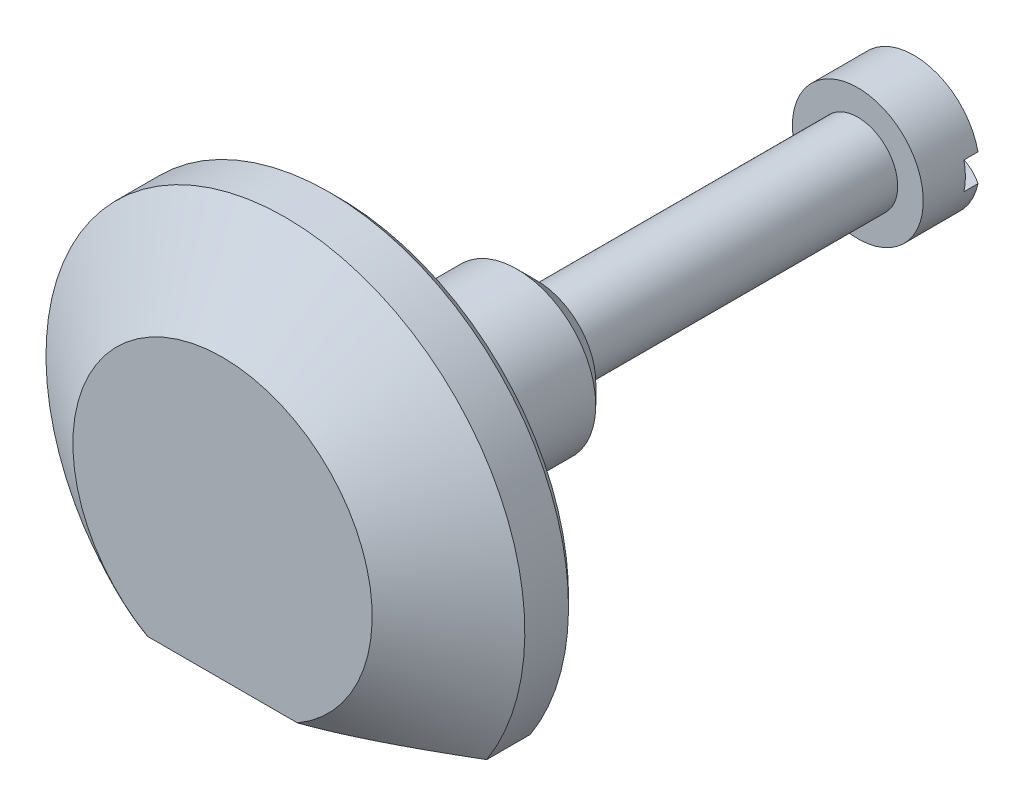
ISO-10303-21;
HEADER;
FILE_DESCRIPTION(('STEP AP214'),'2;1');
FILE_NAME('part.step','',(''),(''),'','','');
FILE_SCHEMA(('AUTOMOTIVE_DESIGN { 1 0 10303 214 1 1 1 1 }'));
ENDSEC;
DATA;
#1=APPLICATION_CONTEXT('core data for automotive mechanical design processes');
#2=APPLICATION_PROTOCOL_DEFINITION('international standard','automotive_design',2000,#1);
#3=PRODUCT_CONTEXT('',#1,'mechanical');
#4=PRODUCT('Part','Part','',(#3));
#5=PRODUCT_RELATED_PRODUCT_CATEGORY('part','',(#4));
#6=PRODUCT_DEFINITION_FORMATION('','',#4);
#7=PRODUCT_DEFINITION_CONTEXT('part definition',#1,'design');
#8=PRODUCT_DEFINITION('design','',#6,#7);
#9=PRODUCT_DEFINITION_SHAPE('','',#8);
#10=(LENGTH_UNIT() NAMED_UNIT(*) SI_UNIT(.MILLI.,.METRE.));
#11=(NAMED_UNIT(*) PLANE_ANGLE_UNIT() SI_UNIT($,.RADIAN.));
#12=(NAMED_UNIT(*) SI_UNIT($,.STERADIAN.) SOLID_ANGLE_UNIT());
#13=UNCERTAINTY_MEASURE_WITH_UNIT(LENGTH_MEASURE(1.E-05),#10,'distance_accuracy_value','');
#14=(GEOMETRIC_REPRESENTATION_CONTEXT(3) GLOBAL_UNCERTAINTY_ASSIGNED_CONTEXT((#13)) GLOBAL_UNIT_ASSIGNED_CONTEXT((#10,
#11,#12)) REPRESENTATION_CONTEXT('',''));
#15=CARTESIAN_POINT('',(0.,0.,0.));
#16=DIRECTION('',(0.,0.,1.));
#17=DIRECTION('',(1.,0.,0.));
#18=AXIS2_PLACEMENT_3D('',#15,#16,#17);
#19=CARTESIAN_POINT('',(0.,3.13055,0.));
#20=DIRECTION('',(0.,0.,1.));
#21=DIRECTION('',(1.,0.,0.));
#22=AXIS2_PLACEMENT_3D('',#19,#20,#21);
#23=PLANE('',#22);
#24=CARTESIAN_POINT('',(0.,0.,0.));
#25=DIRECTION('',(0.,0.,1.));
#26=DIRECTION('',(1.,0.,0.));
#27=AXIS2_PLACEMENT_3D('',#24,#25,#26);
#28=CIRCLE('',#27,3.13055);
#29=CARTESIAN_POINT('',(3.13055,0.,0.));
#30=VERTEX_POINT('',#29);
#31=EDGE_CURVE('E176',#30,#30,#28,.T.);
#32=ORIENTED_EDGE('',*,*,#31,.T.);
#33=EDGE_LOOP('',(#32));
#34=FACE_BOUND('',#33,.T.);
#35=DIRECTION('',(1.,0.,0.));
#36=VECTOR('',#35,1.);
#37=CARTESIAN_POINT('',(0.,-5.1562,0.));
#38=LINE('',#37,#36);
#39=CARTESIAN_POINT('',(-7.53311759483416,-5.1562,0.));
#40=VERTEX_POINT('',#39);
#41=CARTESIAN_POINT('',(7.53311759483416,-5.1562,0.));
#42=VERTEX_POINT('',#41);
#43=EDGE_CURVE('E60',#40,#42,#38,.T.);
#44=ORIENTED_EDGE('',*,*,#43,.F.);
#45=CARTESIAN_POINT('',(0.,0.,0.));
#46=DIRECTION('',(0.,0.,1.));
#47=DIRECTION('',(1.,0.,0.));
#48=AXIS2_PLACEMENT_3D('',#45,#46,#47);
#49=CIRCLE('',#48,9.12876);
#50=EDGE_CURVE('E174',#42,#40,#49,.T.);
#51=ORIENTED_EDGE('',*,*,#50,.F.);
#52=EDGE_LOOP('',(#44,#51));
#53=FACE_BOUND('',#52,.T.);
#54=ADVANCED_FACE('F14',(#34,#53),#23,.F.);
#55=CARTESIAN_POINT('',(0.,0.,0.));
#56=DIRECTION('',(0.,0.,1.));
#57=DIRECTION('',(1.,0.,0.));
#58=AXIS2_PLACEMENT_3D('',#55,#56,#57);
#59=CONICAL_SURFACE('',#58,9.12876,0.785398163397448);
#60=CARTESIAN_POINT('',(-15.2490444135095,-5.1562,6.9684370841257));
#61=CARTESIAN_POINT('',(-14.9291086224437,-5.1562,6.66537868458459));
#62=CARTESIAN_POINT('',(-14.6087024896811,-5.1562,6.36281474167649));
#63=CARTESIAN_POINT('',(-13.9667153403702,-5.1562,5.75893611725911));
#64=CARTESIAN_POINT('',(-13.6451343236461,-5.1562,5.45762143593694));
#65=CARTESIAN_POINT('',(-13.0006472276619,-5.1562,4.85658004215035));
#66=CARTESIAN_POINT('',(-12.677741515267,-5.1562,4.55685293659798));
#67=CARTESIAN_POINT('',(-12.0302017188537,-5.1562,3.95927180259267));
#68=CARTESIAN_POINT('',(-11.7055676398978,-5.1562,3.66141776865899));
#69=CARTESIAN_POINT('',(-11.054076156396,-5.1562,3.06799840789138));
#70=CARTESIAN_POINT('',(-10.7272182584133,-5.1562,2.77243362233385));
#71=CARTESIAN_POINT('',(-10.0707990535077,-5.1562,2.18433331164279));
#72=CARTESIAN_POINT('',(-9.74123782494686,-5.1562,1.89179769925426));
#73=CARTESIAN_POINT('',(-9.24423119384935,-5.1562,1.45594142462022));
#74=CARTESIAN_POINT('',(-9.07809509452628,-5.1562,1.31112742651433));
#75=CARTESIAN_POINT('',(-8.74482041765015,-5.1562,1.02265926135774));
#76=CARTESIAN_POINT('',(-8.577681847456,-5.1562,0.879005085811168));
#77=CARTESIAN_POINT('',(-8.24223899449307,-5.1562,0.593029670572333));
#78=CARTESIAN_POINT('',(-8.07393460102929,-5.1562,0.450708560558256));
#79=CARTESIAN_POINT('',(-7.73598488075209,-5.1562,0.167659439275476));
#80=CARTESIAN_POINT('',(-7.56633952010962,-5.1562,0.0269314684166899));
#81=CARTESIAN_POINT('',(-7.39593235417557,-5.1562,-0.1128732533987));
#82=B_SPLINE_CURVE_WITH_KNOTS('',3,(#60,#61,#62,#63,#64,#65,#66,#67,#68,#69,#70,#71,#72,#73,#74,
#75,#76,#77,#78,#79,#80,#81),.UNSPECIFIED.,.F.,.F.,(4,2,2,2,2,2,2,2,2,2,4),(0.,1.32205673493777,
2.64411366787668,3.96582632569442,5.28753511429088,6.60954741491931,7.9315215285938,
8.59269093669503,9.25385549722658,9.91508372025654,10.5763286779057),.UNSPECIFIED.);
#83=CARTESIAN_POINT('',(-8.00869693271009,-5.1562,0.39624));
#84=VERTEX_POINT('',#83);
#85=EDGE_CURVE('E151',#84,#40,#82,.T.);
#86=ORIENTED_EDGE('',*,*,#85,.F.);
#87=CARTESIAN_POINT('',(0.,0.,0.39624));
#88=DIRECTION('',(0.,0.,1.));
#89=DIRECTION('',(1.,0.,0.));
#90=AXIS2_PLACEMENT_3D('',#87,#88,#89);
#91=CIRCLE('',#90,9.525);
#92=CARTESIAN_POINT('',(8.00869693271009,-5.1562,0.39624));
#93=VERTEX_POINT('',#92);
#94=EDGE_CURVE('E171',#93,#84,#91,.T.);
#95=ORIENTED_EDGE('',*,*,#94,.F.);
#96=CARTESIAN_POINT('',(7.39593235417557,-5.1562,-0.1128732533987));
#97=CARTESIAN_POINT('',(7.56633952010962,-5.1562,0.0269314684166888));
#98=CARTESIAN_POINT('',(7.73598488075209,-5.1562,0.167659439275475));
#99=CARTESIAN_POINT('',(8.07393460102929,-5.1562,0.450708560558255));
#100=CARTESIAN_POINT('',(8.24223899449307,-5.1562,0.593029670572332));
#101=CARTESIAN_POINT('',(8.577681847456,-5.1562,0.879005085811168));
#102=CARTESIAN_POINT('',(8.74482041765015,-5.1562,1.02265926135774));
#103=CARTESIAN_POINT('',(9.07809509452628,-5.1562,1.31112742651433));
#104=CARTESIAN_POINT('',(9.24423119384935,-5.1562,1.45594142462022));
#105=CARTESIAN_POINT('',(9.74123782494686,-5.1562,1.89179769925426));
#106=CARTESIAN_POINT('',(10.0707990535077,-5.1562,2.1843333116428));
#107=CARTESIAN_POINT('',(10.7272182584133,-5.1562,2.77243362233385));
#108=CARTESIAN_POINT('',(11.054076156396,-5.1562,3.06799840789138));
#109=CARTESIAN_POINT('',(11.7055676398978,-5.1562,3.66141776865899));
#110=CARTESIAN_POINT('',(12.0302017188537,-5.1562,3.95927180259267));
#111=CARTESIAN_POINT('',(12.677741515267,-5.1562,4.55685293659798));
#112=CARTESIAN_POINT('',(13.0006472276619,-5.1562,4.85658004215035));
#113=CARTESIAN_POINT('',(13.6451343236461,-5.1562,5.45762143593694));
#114=CARTESIAN_POINT('',(13.9667153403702,-5.1562,5.75893611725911));
#115=CARTESIAN_POINT('',(14.6087024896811,-5.1562,6.36281474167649));
#116=CARTESIAN_POINT('',(14.9291086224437,-5.1562,6.66537868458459));
#117=CARTESIAN_POINT('',(15.2490444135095,-5.1562,6.9684370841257));
#118=B_SPLINE_CURVE_WITH_KNOTS('',3,(#96,#97,#98,#99,#100,#101,#102,#103,#104,#105,#106,#107,
#108,#109,#110,#111,#112,#113,#114,#115,#116,#117),.UNSPECIFIED.,.F.,.F.,(4,2,2,2,2,2,2,2,2,2,
4),(0.,0.661244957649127,1.32247318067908,1.98363774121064,2.64480714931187,3.96678126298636,
5.28879356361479,6.61050235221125,7.93221501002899,9.2542719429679,10.5763286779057),.UNSPECIFIED.);
#119=EDGE_CURVE('E67',#42,#93,#118,.T.);
#120=ORIENTED_EDGE('',*,*,#119,.F.);
#121=ORIENTED_EDGE('',*,*,#50,.T.);
#122=EDGE_LOOP('',(#86,#95,#120,#121));
#123=FACE_BOUND('',#122,.T.);
#124=ADVANCED_FACE('F144',(#123),#59,.T.);
#125=CARTESIAN_POINT('',(0.,0.,4.6355));
#126=DIRECTION('',(0.,0.,1.));
#127=DIRECTION('',(1.,0.,0.));
#128=AXIS2_PLACEMENT_3D('',#125,#126,#127);
#129=CYLINDRICAL_SURFACE('',#128,9.525);
#130=DIRECTION('',(0.,0.,1.));
#131=VECTOR('',#130,1.);
#132=CARTESIAN_POINT('',(8.00869693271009,-5.1562,4.6355));
#133=LINE('',#132,#131);
#134=CARTESIAN_POINT('',(8.00869693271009,-5.1562,2.13444619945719));
#135=VERTEX_POINT('',#134);
#136=EDGE_CURVE('E163',#93,#135,#133,.T.);
#137=ORIENTED_EDGE('',*,*,#136,.F.);
#138=ORIENTED_EDGE('',*,*,#94,.T.);
#139=DIRECTION('',(0.,0.,1.));
#140=VECTOR('',#139,1.);
#141=CARTESIAN_POINT('',(-8.00869693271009,-5.1562,4.6355));
#142=LINE('',#141,#140);
#143=CARTESIAN_POINT('',(-8.00869693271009,-5.1562,2.13444619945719));
#144=VERTEX_POINT('',#143);
#145=EDGE_CURVE('E128',#144,#84,#142,.F.);
#146=ORIENTED_EDGE('',*,*,#145,.F.);
#147=CARTESIAN_POINT('',(0.,0.,2.13444619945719));
#148=DIRECTION('',(0.,0.,1.));
#149=DIRECTION('',(1.,0.,0.));
#150=AXIS2_PLACEMENT_3D('',#147,#148,#149);
#151=CIRCLE('',#150,9.525);
#152=EDGE_CURVE('E168',#135,#144,#151,.T.);
#153=ORIENTED_EDGE('',*,*,#152,.F.);
#154=EDGE_LOOP('',(#137,#138,#146,#153));
#155=FACE_BOUND('',#154,.T.);
#156=ADVANCED_FACE('F140',(#155),#129,.T.);
#157=CARTESIAN_POINT('',(0.,0.,2.13444619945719));
#158=DIRECTION('',(0.,0.,-1.));
#159=DIRECTION('',(-1.,0.,0.));
#160=AXIS2_PLACEMENT_3D('',#157,#158,#159);
#161=CONICAL_SURFACE('',#160,9.525,0.959931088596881);
#162=CARTESIAN_POINT('',(-16.2946755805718,-5.1562,-3.16333570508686));
#163=CARTESIAN_POINT('',(-15.9418236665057,-5.1562,-2.92779299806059));
#164=CARTESIAN_POINT('',(-15.5886625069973,-5.1562,-2.69271174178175));
#165=CARTESIAN_POINT('',(-14.8815593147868,-5.1562,-2.22371603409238));
#166=CARTESIAN_POINT('',(-14.5276172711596,-5.1562,-1.98980159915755));
#167=CARTESIAN_POINT('',(-13.8186083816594,-5.1562,-1.5232640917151));
#168=CARTESIAN_POINT('',(-13.4635410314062,-5.1562,-1.29064178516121));
#169=CARTESIAN_POINT('',(-12.7522573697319,-5.1562,-0.827163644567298));
#170=CARTESIAN_POINT('',(-12.3960410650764,-5.1562,-0.59630780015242));
#171=CARTESIAN_POINT('',(-11.6814300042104,-5.1562,-0.136341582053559));
#172=CARTESIAN_POINT('',(-11.3230322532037,-5.1562,0.0927641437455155));
#173=CARTESIAN_POINT('',(-10.6044173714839,-5.1562,0.548103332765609));
#174=CARTESIAN_POINT('',(-10.2442002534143,-5.1562,0.774336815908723));
#175=CARTESIAN_POINT('',(-9.52150395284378,-5.1562,1.22298464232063));
#176=CARTESIAN_POINT('',(-9.15902529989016,-5.1562,1.44539983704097));
#177=CARTESIAN_POINT('',(-8.43101285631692,-5.1562,1.88516404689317));
#178=CARTESIAN_POINT('',(-8.06547917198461,-5.1562,2.10251323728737));
#179=CARTESIAN_POINT('',(-7.36381887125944,-5.1562,2.51070930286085));
#180=CARTESIAN_POINT('',(-7.02804809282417,-5.1562,2.70216629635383));
#181=CARTESIAN_POINT('',(-6.35198035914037,-5.1562,3.07712959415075));
#182=CARTESIAN_POINT('',(-6.01168264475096,-5.1562,3.2606345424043));
#183=CARTESIAN_POINT('',(-5.49609912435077,-5.1562,3.52767565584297));
#184=CARTESIAN_POINT('',(-5.32302901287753,-5.1562,3.61548801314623));
#185=CARTESIAN_POINT('',(-4.97515941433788,-5.1562,3.78761013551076));
#186=CARTESIAN_POINT('',(-4.80036000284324,-5.1562,3.87192005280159));
#187=CARTESIAN_POINT('',(-4.44879863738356,-5.1562,4.03628148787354));
#188=CARTESIAN_POINT('',(-4.27203703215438,-5.1562,4.11633374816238));
#189=CARTESIAN_POINT('',(-3.91626142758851,-5.1562,4.27124316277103));
#190=CARTESIAN_POINT('',(-3.73724758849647,-5.1562,4.34610068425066));
#191=CARTESIAN_POINT('',(-3.31813942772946,-5.1562,4.51274431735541));
#192=CARTESIAN_POINT('',(-3.07707950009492,-5.1562,4.60213847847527));
#193=CARTESIAN_POINT('',(-2.58999906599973,-5.1562,4.76639266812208));
#194=CARTESIAN_POINT('',(-2.34397861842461,-5.1562,4.84125286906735));
#195=CARTESIAN_POINT('',(-1.849428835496,-5.1562,4.9716052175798));
#196=CARTESIAN_POINT('',(-1.60095176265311,-5.1562,5.02728966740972));
#197=CARTESIAN_POINT('',(-1.22528151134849,-5.1562,5.09394620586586));
#198=CARTESIAN_POINT('',(-1.09956065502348,-5.1562,5.11335379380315));
#199=CARTESIAN_POINT('',(-0.847339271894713,-5.1562,5.14611473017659));
#200=CARTESIAN_POINT('',(-0.720838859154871,-5.1562,5.15946894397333));
#201=CARTESIAN_POINT('',(-0.465478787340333,-5.1562,5.17993477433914));
#202=CARTESIAN_POINT('',(-0.336611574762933,-5.1562,5.18695276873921));
#203=CARTESIAN_POINT('',(-0.0786856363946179,-5.1562,5.19422000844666));
#204=CARTESIAN_POINT('',(0.0503730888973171,-5.1562,5.19446927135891));
#205=CARTESIAN_POINT('',(0.308325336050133,-5.1562,5.18818969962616));
#206=CARTESIAN_POINT('',(0.437218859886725,-5.1562,5.18166094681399));
#207=CARTESIAN_POINT('',(0.694489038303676,-5.1562,5.16201335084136));
#208=CARTESIAN_POINT('',(0.822865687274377,-5.1562,5.148894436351));
#209=CARTESIAN_POINT('',(1.20931527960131,-5.1562,5.09980511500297));
#210=CARTESIAN_POINT('',(1.46621564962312,-5.1562,5.05417214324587));
#211=CARTESIAN_POINT('',(1.84781769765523,-5.1562,4.96961286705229));
#212=CARTESIAN_POINT('',(1.97441693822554,-5.1562,4.93873419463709));
#213=CARTESIAN_POINT('',(2.22635087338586,-5.1562,4.87218079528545));
#214=CARTESIAN_POINT('',(2.35168562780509,-5.1562,4.83650629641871));
#215=CARTESIAN_POINT('',(2.68420811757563,-5.1562,4.73570944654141));
#216=CARTESIAN_POINT('',(2.89025078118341,-5.1562,4.66681252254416));
#217=CARTESIAN_POINT('',(3.29894868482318,-5.1562,4.51954849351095));
#218=CARTESIAN_POINT('',(3.50160285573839,-5.1562,4.44117846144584));
#219=CARTESIAN_POINT('',(3.90405989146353,-5.1562,4.27680455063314));
#220=CARTESIAN_POINT('',(4.10385897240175,-5.1562,4.19079146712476));
#221=CARTESIAN_POINT('',(4.50072282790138,-5.1562,4.01275840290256));
#222=CARTESIAN_POINT('',(4.69778786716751,-5.1562,3.92073900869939));
#223=CARTESIAN_POINT('',(5.09042450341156,-5.1562,3.73147813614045));
#224=CARTESIAN_POINT('',(5.2859860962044,-5.1562,3.63421598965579));
#225=CARTESIAN_POINT('',(5.67510716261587,-5.1562,3.43577038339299));
#226=CARTESIAN_POINT('',(5.86866659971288,-5.1562,3.33458685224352));
#227=CARTESIAN_POINT('',(6.25395450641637,-5.1562,3.12909736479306));
#228=CARTESIAN_POINT('',(6.44568408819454,-5.1562,3.02479348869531));
#229=CARTESIAN_POINT('',(6.82769447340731,-5.1562,2.81356203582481));
#230=CARTESIAN_POINT('',(7.01797524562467,-5.1562,2.7066344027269));
#231=CARTESIAN_POINT('',(7.59406162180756,-5.1562,2.37857455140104));
#232=CARTESIAN_POINT('',(7.97792906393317,-5.1562,2.15403955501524));
#233=CARTESIAN_POINT('',(8.74196372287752,-5.1562,1.69868588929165));
#234=CARTESIAN_POINT('',(9.12213044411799,-5.1562,1.46786639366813));
#235=CARTESIAN_POINT('',(9.8785742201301,-5.1562,1.00233518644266));
#236=CARTESIAN_POINT('',(10.2548592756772,-5.1562,0.767636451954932));
#237=CARTESIAN_POINT('',(11.0052756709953,-5.1562,0.294867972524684));
#238=CARTESIAN_POINT('',(11.3794071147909,-5.1562,0.0567983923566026));
#239=CARTESIAN_POINT('',(12.0740348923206,-5.1562,-0.388606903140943));
#240=CARTESIAN_POINT('',(12.3947467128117,-5.1562,-0.595607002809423));
#241=CARTESIAN_POINT('',(13.0351611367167,-5.1562,-1.01116310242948));
#242=CARTESIAN_POINT('',(13.3548637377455,-5.1562,-1.21971910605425));
#243=CARTESIAN_POINT('',(14.3127378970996,-5.1562,-1.84728598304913));
#244=CARTESIAN_POINT('',(14.9496683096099,-5.1562,-2.26819089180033));
#245=CARTESIAN_POINT('',(16.2212449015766,-5.1562,-3.11350970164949));
#246=CARTESIAN_POINT('',(16.8558909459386,-5.1562,-3.53792380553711));
#247=CARTESIAN_POINT('',(18.123487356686,-5.1562,-4.38927846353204));
#248=CARTESIAN_POINT('',(18.756437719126,-5.1562,-4.81621902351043));
#249=CARTESIAN_POINT('',(20.0219217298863,-5.1562,-5.67255757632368));
#250=CARTESIAN_POINT('',(20.6544536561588,-5.1562,-6.10195811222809));
#251=CARTESIAN_POINT('',(21.9185355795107,-5.1562,-6.96220350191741));
#252=CARTESIAN_POINT('',(22.5500855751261,-5.1562,-7.39304835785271));
#253=CARTESIAN_POINT('',(24.4435518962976,-5.1562,-8.68722608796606));
#254=CARTESIAN_POINT('',(25.7043257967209,-5.1562,-9.55223009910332));
#255=CARTESIAN_POINT('',(28.117202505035,-5.1562,-11.2116930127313));
#256=CARTESIAN_POINT('',(29.2694642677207,-5.1562,-12.0059210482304));
#257=CARTESIAN_POINT('',(31.5728313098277,-5.1562,-13.5960765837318));
#258=CARTESIAN_POINT('',(32.723936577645,-5.1562,-14.3920041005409));
#259=CARTESIAN_POINT('',(35.0236143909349,-5.1562,-15.983918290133));
#260=CARTESIAN_POINT('',(36.172188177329,-5.1562,-16.7799031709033));
#261=CARTESIAN_POINT('',(38.4686728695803,-5.1562,-18.3728016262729));
#262=CARTESIAN_POINT('',(39.6165837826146,-5.1562,-19.1697151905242));
#263=CARTESIAN_POINT('',(40.7642674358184,-5.1562,-19.966955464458));
#264=B_SPLINE_CURVE_WITH_KNOTS('',3,(#162,#163,#164,#165,#166,#167,#168,#169,#170,#171,#172,
#173,#174,#175,#176,#177,#178,#179,#180,#181,#182,#183,#184,#185,#186,#187,#188,#189,#190,#191,
#192,#193,#194,#195,#196,#197,#198,#199,#200,#201,#202,#203,#204,#205,#206,#207,#208,#209,#210,
#211,#212,#213,#214,#215,#216,#217,#218,#219,#220,#221,#222,#223,#224,#225,#226,#227,#228,#229,
#230,#231,#232,#233,#234,#235,#236,#237,#238,#239,#240,#241,#242,#243,#244,#245,#246,#247,#248,
#249,#250,#251,#252,#253,#254,#255,#256,#257,#258,#259,#260,#261,#262,#263),.UNSPECIFIED.,.F.,
.F.,(4,2,2,2,2,2,2,2,2,2,2,2,2,2,2,2,2,2,2,2,2,2,2,2,2,2,2,2,2,2,2,2,2,2,2,2,2,2,2,2,2,2,2,2,2,
2,2,2,2,2,4),(0.,1.27273974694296,2.54549741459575,3.81894270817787,5.09238051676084,
6.36847579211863,7.6445622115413,8.92036027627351,10.1961141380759,11.355606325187,
12.5152954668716,13.0974832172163,13.6796456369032,14.2617061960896,14.843725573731,
15.6146610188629,16.3855873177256,17.1485404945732,17.5300470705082,17.9114990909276,
18.2984992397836,18.6854983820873,19.0724928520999,19.4594915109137,20.2409350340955,
20.6318029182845,21.0226522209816,21.6741107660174,22.3257711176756,22.9782272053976,
23.6306196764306,24.2858048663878,24.9410019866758,25.5957716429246,26.2505553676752,
27.5845975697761,28.918816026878,30.2492295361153,31.5795782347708,32.7247131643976,
33.8698507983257,36.1601528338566,38.4505881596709,40.7410288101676,43.034567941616,
45.3281104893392,49.915046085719,54.1134428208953,58.311881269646,62.5041740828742,
66.6964206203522),.UNSPECIFIED.);
#265=CARTESIAN_POINT('',(2.97544934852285,-5.1562,4.6355));
#266=VERTEX_POINT('',#265);
#267=EDGE_CURVE('E129',#135,#266,#264,.F.);
#268=ORIENTED_EDGE('',*,*,#267,.F.);
#269=ORIENTED_EDGE('',*,*,#152,.T.);
#270=CARTESIAN_POINT('',(-2.97544934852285,-5.1562,4.6355));
#271=VERTEX_POINT('',#270);
#272=EDGE_CURVE('E119',#271,#144,#264,.F.);
#273=ORIENTED_EDGE('',*,*,#272,.F.);
#274=CARTESIAN_POINT('',(0.,0.,4.6355));
#275=DIRECTION('',(0.,0.,1.));
#276=DIRECTION('',(1.,0.,0.));
#277=AXIS2_PLACEMENT_3D('',#274,#275,#276);
#278=CIRCLE('',#277,5.953125);
#279=EDGE_CURVE('E166',#266,#271,#278,.T.);
#280=ORIENTED_EDGE('',*,*,#279,.F.);
#281=EDGE_LOOP('',(#268,#269,#273,#280));
#282=FACE_BOUND('',#281,.T.);
#283=ADVANCED_FACE('F135',(#282),#161,.T.);
#284=CARTESIAN_POINT('',(0.,5.953125,4.6355));
#285=DIRECTION('',(0.,0.,-1.));
#286=DIRECTION('',(-1.,0.,0.));
#287=AXIS2_PLACEMENT_3D('',#284,#285,#286);
#288=PLANE('',#287);
#289=DIRECTION('',(-1.,0.,0.));
#290=VECTOR('',#289,1.);
#291=CARTESIAN_POINT('',(0.,-5.1562,4.6355));
#292=LINE('',#291,#290);
#293=EDGE_CURVE('E184',#266,#271,#292,.T.);
#294=ORIENTED_EDGE('',*,*,#293,.F.);
#295=ORIENTED_EDGE('',*,*,#279,.T.);
#296=EDGE_LOOP('',(#294,#295));
#297=FACE_BOUND('',#296,.T.);
#298=ADVANCED_FACE('F139',(#297),#288,.F.);
#299=CARTESIAN_POINT('',(0.,0.,-7.874));
#300=DIRECTION('',(0.,0.,1.));
#301=DIRECTION('',(1.,0.,0.));
#302=AXIS2_PLACEMENT_3D('',#299,#300,#301);
#303=PLANE('',#302);
#304=CARTESIAN_POINT('',(0.,0.,-7.874));
#305=DIRECTION('',(0.,0.,1.));
#306=DIRECTION('',(1.,0.,0.));
#307=AXIS2_PLACEMENT_3D('',#304,#305,#306);
#308=CIRCLE('',#307,2.33807);
#309=CARTESIAN_POINT('',(2.33807,0.,-7.874));
#310=VERTEX_POINT('',#309);
#311=EDGE_CURVE('E182',#310,#310,#308,.T.);
#312=ORIENTED_EDGE('',*,*,#311,.F.);
#313=EDGE_LOOP('',(#312));
#314=FACE_BOUND('',#313,.T.);
#315=CARTESIAN_POINT('',(0.,0.,-7.874));
#316=DIRECTION('',(0.,0.,-1.));
#317=DIRECTION('',(0.,-1.,0.));
#318=AXIS2_PLACEMENT_3D('',#315,#316,#317);
#319=CIRCLE('',#318,1.5875);
#320=CARTESIAN_POINT('',(0.,-1.5875,-7.874));
#321=VERTEX_POINT('',#320);
#322=EDGE_CURVE('E9',#321,#321,#319,.F.);
#323=ORIENTED_EDGE('',*,*,#322,.T.);
#324=EDGE_LOOP('',(#323));
#325=FACE_BOUND('',#324,.T.);
#326=ADVANCED_FACE('F16',(#314,#325),#303,.F.);
#327=CARTESIAN_POINT('',(0.,0.,-7.874));
#328=DIRECTION('',(0.,0.,1.));
#329=DIRECTION('',(1.,0.,0.));
#330=AXIS2_PLACEMENT_3D('',#327,#328,#329);
#331=CONICAL_SURFACE('',#330,2.33807,0.785398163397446);
#332=CARTESIAN_POINT('',(0.,0.,-7.08152));
#333=DIRECTION('',(0.,0.,1.));
#334=DIRECTION('',(1.,0.,0.));
#335=AXIS2_PLACEMENT_3D('',#332,#333,#334);
#336=CIRCLE('',#335,3.13055);
#337=CARTESIAN_POINT('',(3.13055,0.,-7.08152));
#338=VERTEX_POINT('',#337);
#339=EDGE_CURVE('E179',#338,#338,#336,.T.);
#340=ORIENTED_EDGE('',*,*,#339,.F.);
#341=EDGE_LOOP('',(#340));
#342=FACE_BOUND('',#341,.T.);
#343=ORIENTED_EDGE('',*,*,#311,.T.);
#344=EDGE_LOOP('',(#343));
#345=FACE_BOUND('',#344,.T.);
#346=ADVANCED_FACE('F221',(#342,#345),#331,.T.);
#347=CARTESIAN_POINT('',(0.,0.,4.6355));
#348=DIRECTION('',(0.,0.,1.));
#349=DIRECTION('',(1.,0.,0.));
#350=AXIS2_PLACEMENT_3D('',#347,#348,#349);
#351=CYLINDRICAL_SURFACE('',#350,3.13055);
#352=ORIENTED_EDGE('',*,*,#31,.F.);
#353=EDGE_LOOP('',(#352));
#354=FACE_BOUND('',#353,.T.);
#355=ORIENTED_EDGE('',*,*,#339,.T.);
#356=EDGE_LOOP('',(#355));
#357=FACE_BOUND('',#356,.T.);
#358=ADVANCED_FACE('F218',(#354,#357),#351,.T.);
#359=CARTESIAN_POINT('',(12.0056788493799,-5.1562,4.6355));
#360=DIRECTION('',(0.,-1.,0.));
#361=DIRECTION('',(-1.,0.,0.));
#362=AXIS2_PLACEMENT_3D('',#359,#360,#361);
#363=PLANE('',#362);
#364=ORIENTED_EDGE('',*,*,#136,.T.);
#365=ORIENTED_EDGE('',*,*,#267,.T.);
#366=ORIENTED_EDGE('',*,*,#293,.T.);
#367=ORIENTED_EDGE('',*,*,#272,.T.);
#368=ORIENTED_EDGE('',*,*,#145,.T.);
#369=ORIENTED_EDGE('',*,*,#85,.T.);
#370=ORIENTED_EDGE('',*,*,#43,.T.);
#371=ORIENTED_EDGE('',*,*,#119,.T.);
#372=EDGE_LOOP('',(#364,#365,#366,#367,#368,#369,#370,#371));
#373=FACE_BOUND('',#372,.T.);
#374=ADVANCED_FACE('F131',(#373),#363,.T.);
#375=CARTESIAN_POINT('',(0.,0.,-19.10943203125));
#376=DIRECTION('',(0.,0.,-1.));
#377=DIRECTION('',(0.,1.,0.));
#378=AXIS2_PLACEMENT_3D('',#375,#376,#377);
#379=SPHERICAL_SURFACE('',#378,4.57606796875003);
#380=CARTESIAN_POINT('',(0.,0.,-22.8727));
#381=DIRECTION('',(0.,0.,-1.));
#382=DIRECTION('',(-1.,0.,0.));
#383=AXIS2_PLACEMENT_3D('',#380,#381,#382);
#384=CIRCLE('',#383,2.6035);
#385=CARTESIAN_POINT('',(2.54558186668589,-0.5461,-22.8727));
#386=VERTEX_POINT('',#385);
#387=CARTESIAN_POINT('',(-2.54558186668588,-0.5461,-22.8727));
#388=VERTEX_POINT('',#387);
#389=EDGE_CURVE('E99',#386,#388,#384,.T.);
#390=ORIENTED_EDGE('',*,*,#389,.T.);
#391=CARTESIAN_POINT('',(0.,-0.5461,-19.10943203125));
#392=DIRECTION('',(0.,1.,0.));
#393=DIRECTION('',(-1.,0.,0.));
#394=AXIS2_PLACEMENT_3D('',#391,#392,#393);
#395=CIRCLE('',#394,4.54336580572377);
#396=EDGE_CURVE('E85',#388,#386,#395,.F.);
#397=ORIENTED_EDGE('',*,*,#396,.T.);
#398=EDGE_LOOP('',(#390,#397));
#399=FACE_BOUND('',#398,.T.);
#400=ADVANCED_FACE('F104',(#399),#379,.T.);
#401=CARTESIAN_POINT('',(-2.54558186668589,0.5461,-22.8727));
#402=VERTEX_POINT('',#401);
#403=CARTESIAN_POINT('',(2.54558186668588,0.5461,-22.8727));
#404=VERTEX_POINT('',#403);
#405=EDGE_CURVE('E105',#402,#404,#384,.T.);
#406=ORIENTED_EDGE('',*,*,#405,.T.);
#407=CARTESIAN_POINT('',(0.,0.5461,-19.10943203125));
#408=DIRECTION('',(0.,-1.,0.));
#409=DIRECTION('',(1.,0.,0.));
#410=AXIS2_PLACEMENT_3D('',#407,#408,#409);
#411=CIRCLE('',#410,4.54336580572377);
#412=EDGE_CURVE('E95',#404,#402,#411,.F.);
#413=ORIENTED_EDGE('',*,*,#412,.T.);
#414=EDGE_LOOP('',(#406,#413));
#415=FACE_BOUND('',#414,.T.);
#416=ADVANCED_FACE('F248',(#415),#379,.T.);
#417=CARTESIAN_POINT('',(-2.6035,0.5461,-22.3139));
#418=DIRECTION('',(0.,-1.,0.));
#419=DIRECTION('',(1.,0.,0.));
#420=AXIS2_PLACEMENT_3D('',#417,#418,#419);
#421=PLANE('',#420);
#422=DIRECTION('',(0.,0.,-1.));
#423=VECTOR('',#422,1.);
#424=CARTESIAN_POINT('',(-2.54558186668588,0.5461,-49.0855));
#425=LINE('',#424,#423);
#426=CARTESIAN_POINT('',(-2.54558186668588,0.5461,-22.3139));
#427=VERTEX_POINT('',#426);
#428=EDGE_CURVE('E102',#427,#402,#425,.T.);
#429=ORIENTED_EDGE('',*,*,#428,.T.);
#430=ORIENTED_EDGE('',*,*,#412,.F.);
#431=DIRECTION('',(0.,0.,-1.));
#432=VECTOR('',#431,1.);
#433=CARTESIAN_POINT('',(2.54558186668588,0.5461,-49.0855));
#434=LINE('',#433,#432);
#435=CARTESIAN_POINT('',(2.54558186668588,0.5461,-22.3139));
#436=VERTEX_POINT('',#435);
#437=EDGE_CURVE('E115',#404,#436,#434,.F.);
#438=ORIENTED_EDGE('',*,*,#437,.T.);
#439=DIRECTION('',(-1.,0.,0.));
#440=VECTOR('',#439,1.);
#441=CARTESIAN_POINT('',(-2.6035,0.5461,-22.3139));
#442=LINE('',#441,#440);
#443=EDGE_CURVE('E188',#436,#427,#442,.T.);
#444=ORIENTED_EDGE('',*,*,#443,.T.);
#445=EDGE_LOOP('',(#429,#430,#438,#444));
#446=FACE_BOUND('',#445,.T.);
#447=ADVANCED_FACE('F253',(#446),#421,.T.);
#448=CARTESIAN_POINT('',(-2.6035,-0.5461,-22.3139));
#449=DIRECTION('',(0.,0.,-1.));
#450=DIRECTION('',(-1.,0.,0.));
#451=AXIS2_PLACEMENT_3D('',#448,#449,#450);
#452=PLANE('',#451);
#453=ORIENTED_EDGE('',*,*,#443,.F.);
#454=CARTESIAN_POINT('',(0.,0.,-22.3139));
#455=DIRECTION('',(0.,0.,-1.));
#456=DIRECTION('',(-1.,0.,0.));
#457=AXIS2_PLACEMENT_3D('',#454,#455,#456);
#458=CIRCLE('',#457,2.6035);
#459=CARTESIAN_POINT('',(2.54558186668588,-0.5461,-22.3139));
#460=VERTEX_POINT('',#459);
#461=EDGE_CURVE('E72',#436,#460,#458,.T.);
#462=ORIENTED_EDGE('',*,*,#461,.T.);
#463=DIRECTION('',(1.,0.,0.));
#464=VECTOR('',#463,1.);
#465=CARTESIAN_POINT('',(2.6035,-0.5461,-22.3139));
#466=LINE('',#465,#464);
#467=CARTESIAN_POINT('',(-2.54558186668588,-0.5461,-22.3139));
#468=VERTEX_POINT('',#467);
#469=EDGE_CURVE('E31',#468,#460,#466,.T.);
#470=ORIENTED_EDGE('',*,*,#469,.F.);
#471=EDGE_CURVE('E101',#468,#427,#458,.T.);
#472=ORIENTED_EDGE('',*,*,#471,.T.);
#473=EDGE_LOOP('',(#453,#462,#470,#472));
#474=FACE_BOUND('',#473,.T.);
#475=ADVANCED_FACE('F261',(#474),#452,.T.);
#476=CARTESIAN_POINT('',(2.6035,-0.5461,-22.3139));
#477=DIRECTION('',(0.,1.,0.));
#478=DIRECTION('',(-1.,0.,0.));
#479=AXIS2_PLACEMENT_3D('',#476,#477,#478);
#480=PLANE('',#479);
#481=DIRECTION('',(0.,0.,-1.));
#482=VECTOR('',#481,1.);
#483=CARTESIAN_POINT('',(2.54558186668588,-0.5461,-49.0855));
#484=LINE('',#483,#482);
#485=EDGE_CURVE('E23',#460,#386,#484,.T.);
#486=ORIENTED_EDGE('',*,*,#485,.T.);
#487=ORIENTED_EDGE('',*,*,#396,.F.);
#488=DIRECTION('',(0.,0.,-1.));
#489=VECTOR('',#488,1.);
#490=CARTESIAN_POINT('',(-2.54558186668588,-0.5461,-49.0855));
#491=LINE('',#490,#489);
#492=EDGE_CURVE('E88',#388,#468,#491,.F.);
#493=ORIENTED_EDGE('',*,*,#492,.T.);
#494=ORIENTED_EDGE('',*,*,#469,.T.);
#495=EDGE_LOOP('',(#486,#487,#493,#494));
#496=FACE_BOUND('',#495,.T.);
#497=ADVANCED_FACE('F87',(#496),#480,.T.);
#498=CARTESIAN_POINT('',(0.,0.,-49.0855));
#499=DIRECTION('',(0.,0.,-1.));
#500=DIRECTION('',(-1.,0.,0.));
#501=AXIS2_PLACEMENT_3D('',#498,#499,#500);
#502=CYLINDRICAL_SURFACE('',#501,2.6035);
#503=CARTESIAN_POINT('',(0.,0.,-20.6375));
#504=DIRECTION('',(0.,0.,-1.));
#505=DIRECTION('',(-1.,0.,0.));
#506=AXIS2_PLACEMENT_3D('',#503,#504,#505);
#507=CIRCLE('',#506,2.6035);
#508=CARTESIAN_POINT('',(-2.6035,0.,-20.6375));
#509=VERTEX_POINT('',#508);
#510=EDGE_CURVE('E106',#509,#509,#507,.T.);
#511=ORIENTED_EDGE('',*,*,#510,.T.);
#512=EDGE_LOOP('',(#511));
#513=FACE_BOUND('',#512,.T.);
#514=ORIENTED_EDGE('',*,*,#485,.F.);
#515=ORIENTED_EDGE('',*,*,#461,.F.);
#516=ORIENTED_EDGE('',*,*,#437,.F.);
#517=ORIENTED_EDGE('',*,*,#405,.F.);
#518=ORIENTED_EDGE('',*,*,#428,.F.);
#519=ORIENTED_EDGE('',*,*,#471,.F.);
#520=ORIENTED_EDGE('',*,*,#492,.F.);
#521=ORIENTED_EDGE('',*,*,#389,.F.);
#522=EDGE_LOOP('',(#514,#515,#516,#517,#518,#519,#520,#521));
#523=FACE_BOUND('',#522,.T.);
#524=ADVANCED_FACE('F98',(#513,#523),#502,.T.);
#525=CARTESIAN_POINT('',(0.,1.5875,-20.6375));
#526=DIRECTION('',(0.,0.,-1.));
#527=DIRECTION('',(-1.,0.,0.));
#528=AXIS2_PLACEMENT_3D('',#525,#526,#527);
#529=PLANE('',#528);
#530=ORIENTED_EDGE('',*,*,#510,.F.);
#531=EDGE_LOOP('',(#530));
#532=FACE_BOUND('',#531,.T.);
#533=CARTESIAN_POINT('',(0.,0.,-20.6375));
#534=DIRECTION('',(0.,0.,-1.));
#535=DIRECTION('',(-1.,0.,0.));
#536=AXIS2_PLACEMENT_3D('',#533,#534,#535);
#537=CIRCLE('',#536,1.5875);
#538=CARTESIAN_POINT('',(-1.5875,0.,-20.6375));
#539=VERTEX_POINT('',#538);
#540=EDGE_CURVE('E94',#539,#539,#537,.T.);
#541=ORIENTED_EDGE('',*,*,#540,.T.);
#542=EDGE_LOOP('',(#541));
#543=FACE_BOUND('',#542,.T.);
#544=ADVANCED_FACE('F197',(#532,#543),#529,.F.);
#545=CARTESIAN_POINT('',(0.,0.,-49.0855));
#546=DIRECTION('',(0.,0.,-1.));
#547=DIRECTION('',(-1.,0.,0.));
#548=AXIS2_PLACEMENT_3D('',#545,#546,#547);
#549=CYLINDRICAL_SURFACE('',#548,1.5875);
#550=ORIENTED_EDGE('',*,*,#322,.F.);
#551=EDGE_LOOP('',(#550));
#552=FACE_BOUND('',#551,.T.);
#553=ORIENTED_EDGE('',*,*,#540,.F.);
#554=EDGE_LOOP('',(#553));
#555=FACE_BOUND('',#554,.T.);
#556=ADVANCED_FACE('F199',(#552,#555),#549,.T.);
#557=CLOSED_SHELL('',(#54,#124,#156,#283,#298,#326,#346,#358,#374,#400,#416,#447,#475,#497,#524,
#544,#556));
#558=MANIFOLD_SOLID_BREP('B1',#557);
#559=ADVANCED_BREP_SHAPE_REPRESENTATION('',(#18,#558),#14);
#560=SHAPE_DEFINITION_REPRESENTATION(#9,#559);
ENDSEC;
END-ISO-10303-21;
